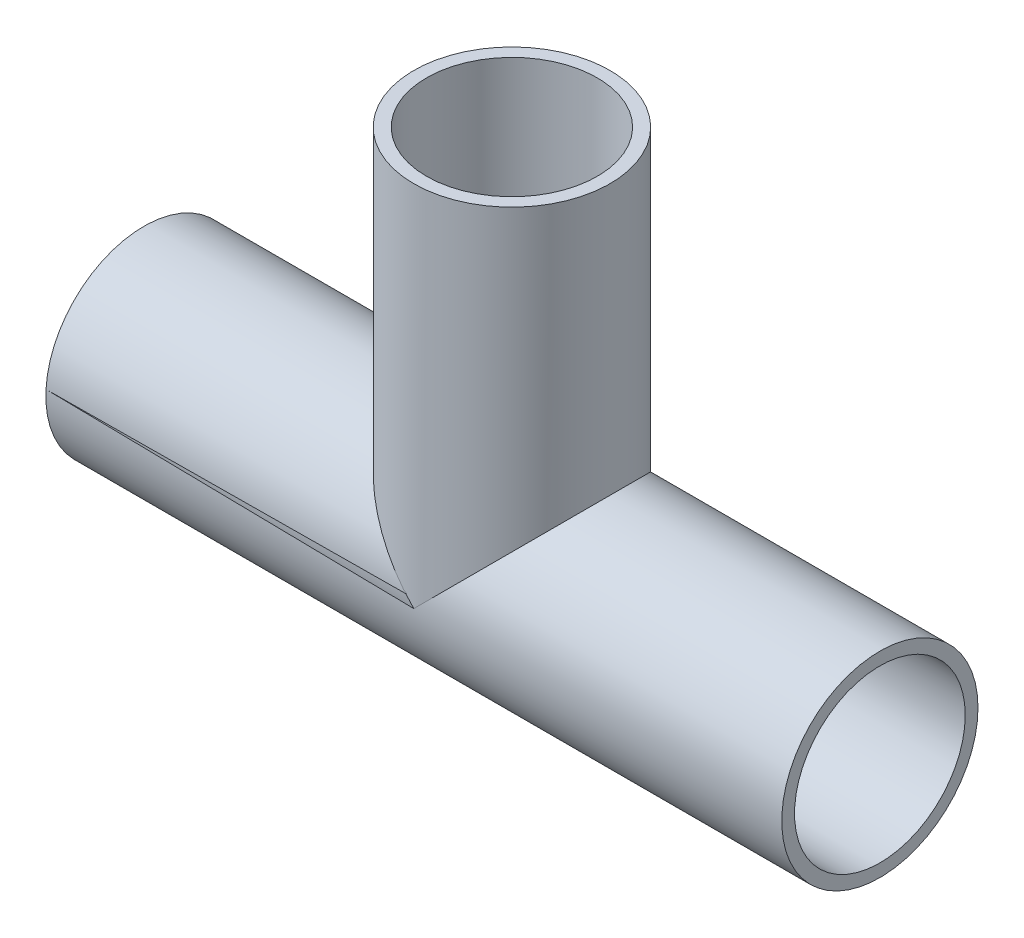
ISO-10303-21;
HEADER;
FILE_DESCRIPTION(('STEP AP214'),'2;1');
FILE_NAME('part.step','',(''),(''),'','','');
FILE_SCHEMA(('AUTOMOTIVE_DESIGN { 1 0 10303 214 1 1 1 1 }'));
ENDSEC;
DATA;
#1=APPLICATION_CONTEXT('core data for automotive mechanical design processes');
#2=APPLICATION_PROTOCOL_DEFINITION('international standard','automotive_design',2000,#1);
#3=PRODUCT_CONTEXT('',#1,'mechanical');
#4=PRODUCT('Part','Part','',(#3));
#5=PRODUCT_RELATED_PRODUCT_CATEGORY('part','',(#4));
#6=PRODUCT_DEFINITION_FORMATION('','',#4);
#7=PRODUCT_DEFINITION_CONTEXT('part definition',#1,'design');
#8=PRODUCT_DEFINITION('design','',#6,#7);
#9=PRODUCT_DEFINITION_SHAPE('','',#8);
#10=(LENGTH_UNIT() NAMED_UNIT(*) SI_UNIT(.MILLI.,.METRE.));
#11=(NAMED_UNIT(*) PLANE_ANGLE_UNIT() SI_UNIT($,.RADIAN.));
#12=(NAMED_UNIT(*) SI_UNIT($,.STERADIAN.) SOLID_ANGLE_UNIT());
#13=UNCERTAINTY_MEASURE_WITH_UNIT(LENGTH_MEASURE(1.E-05),#10,'distance_accuracy_value','');
#14=(GEOMETRIC_REPRESENTATION_CONTEXT(3) GLOBAL_UNCERTAINTY_ASSIGNED_CONTEXT((#13)) GLOBAL_UNIT_ASSIGNED_CONTEXT((#10,
#11,#12)) REPRESENTATION_CONTEXT('',''));
#15=CARTESIAN_POINT('',(0.,0.,0.));
#16=DIRECTION('',(0.,0.,1.));
#17=DIRECTION('',(1.,0.,0.));
#18=AXIS2_PLACEMENT_3D('',#15,#16,#17);
#19=CARTESIAN_POINT('',(-47.625,0.,0.));
#20=DIRECTION('',(1.,0.,0.));
#21=DIRECTION('',(0.,0.,-1.));
#22=AXIS2_PLACEMENT_3D('',#19,#20,#21);
#23=CYLINDRICAL_SURFACE('',#22,12.7);
#24=CARTESIAN_POINT('',(47.625,0.,0.));
#25=DIRECTION('',(1.,0.,0.));
#26=DIRECTION('',(0.,0.,-1.));
#27=AXIS2_PLACEMENT_3D('',#24,#25,#26);
#28=CIRCLE('',#27,12.7);
#29=CARTESIAN_POINT('',(47.625,0.,-12.7));
#30=VERTEX_POINT('',#29);
#31=EDGE_CURVE('E75',#30,#30,#28,.T.);
#32=ORIENTED_EDGE('',*,*,#31,.F.);
#33=EDGE_LOOP('',(#32));
#34=FACE_BOUND('',#33,.T.);
#35=CARTESIAN_POINT('',(-47.625,0.,0.));
#36=DIRECTION('',(1.,0.,0.));
#37=DIRECTION('',(0.,0.,-1.));
#38=AXIS2_PLACEMENT_3D('',#35,#36,#37);
#39=CIRCLE('',#38,12.7);
#40=CARTESIAN_POINT('',(-47.625,0.,-12.7));
#41=VERTEX_POINT('',#40);
#42=EDGE_CURVE('E78',#41,#41,#39,.T.);
#43=ORIENTED_EDGE('',*,*,#42,.T.);
#44=EDGE_LOOP('',(#43));
#45=FACE_BOUND('',#44,.T.);
#46=CARTESIAN_POINT('',(0.,0.,0.));
#47=DIRECTION('',(0.707106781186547,-0.707106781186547,0.));
#48=DIRECTION('',(-0.707106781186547,-0.707106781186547,0.));
#49=AXIS2_PLACEMENT_3D('',#46,#47,#48);
#50=ELLIPSE('',#49,17.9605122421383,12.7);
#51=CARTESIAN_POINT('',(0.,0.,12.7));
#52=VERTEX_POINT('',#51);
#53=CARTESIAN_POINT('',(0.,0.,-12.7));
#54=VERTEX_POINT('',#53);
#55=EDGE_CURVE('E41',#52,#54,#50,.F.);
#56=ORIENTED_EDGE('',*,*,#55,.F.);
#57=CARTESIAN_POINT('',(0.,0.,0.));
#58=DIRECTION('',(-0.707106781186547,-0.707106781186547,0.));
#59=DIRECTION('',(0.707106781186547,-0.707106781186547,0.));
#60=AXIS2_PLACEMENT_3D('',#57,#58,#59);
#61=ELLIPSE('',#60,17.9605122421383,12.7);
#62=EDGE_CURVE('E81',#54,#52,#61,.F.);
#63=ORIENTED_EDGE('',*,*,#62,.F.);
#64=EDGE_LOOP('',(#56,#63));
#65=FACE_BOUND('',#64,.T.);
#66=ADVANCED_FACE('F33',(#34,#45,#65),#23,.T.);
#67=CARTESIAN_POINT('',(-47.625,0.,0.));
#68=DIRECTION('',(1.,0.,0.));
#69=DIRECTION('',(0.,0.,-1.));
#70=AXIS2_PLACEMENT_3D('',#67,#68,#69);
#71=PLANE('',#70);
#72=CARTESIAN_POINT('',(-47.625,0.,0.));
#73=DIRECTION('',(1.,0.,0.));
#74=DIRECTION('',(0.,0.,-1.));
#75=AXIS2_PLACEMENT_3D('',#72,#73,#74);
#76=CIRCLE('',#75,11.049);
#77=CARTESIAN_POINT('',(-47.625,0.,-11.049));
#78=VERTEX_POINT('',#77);
#79=EDGE_CURVE('E66',#78,#78,#76,.F.);
#80=ORIENTED_EDGE('',*,*,#79,.F.);
#81=EDGE_LOOP('',(#80));
#82=FACE_BOUND('',#81,.T.);
#83=ORIENTED_EDGE('',*,*,#42,.F.);
#84=EDGE_LOOP('',(#83));
#85=FACE_BOUND('',#84,.T.);
#86=ADVANCED_FACE('F84',(#82,#85),#71,.F.);
#87=CARTESIAN_POINT('',(47.625,0.,0.));
#88=DIRECTION('',(1.,0.,0.));
#89=DIRECTION('',(0.,0.,-1.));
#90=AXIS2_PLACEMENT_3D('',#87,#88,#89);
#91=PLANE('',#90);
#92=CARTESIAN_POINT('',(47.625,0.,0.));
#93=DIRECTION('',(1.,0.,0.));
#94=DIRECTION('',(0.,0.,-1.));
#95=AXIS2_PLACEMENT_3D('',#92,#93,#94);
#96=CIRCLE('',#95,11.049);
#97=CARTESIAN_POINT('',(47.625,0.,-11.049));
#98=VERTEX_POINT('',#97);
#99=EDGE_CURVE('E62',#98,#98,#96,.T.);
#100=ORIENTED_EDGE('',*,*,#99,.F.);
#101=EDGE_LOOP('',(#100));
#102=FACE_BOUND('',#101,.T.);
#103=ORIENTED_EDGE('',*,*,#31,.T.);
#104=EDGE_LOOP('',(#103));
#105=FACE_BOUND('',#104,.T.);
#106=ADVANCED_FACE('F90',(#102,#105),#91,.T.);
#107=CARTESIAN_POINT('',(0.,47.625,0.));
#108=DIRECTION('',(0.,-1.,0.));
#109=DIRECTION('',(0.,0.,-1.));
#110=AXIS2_PLACEMENT_3D('',#107,#108,#109);
#111=CYLINDRICAL_SURFACE('',#110,12.7);
#112=CARTESIAN_POINT('',(0.,47.625,0.));
#113=DIRECTION('',(0.,1.,0.));
#114=DIRECTION('',(0.,0.,1.));
#115=AXIS2_PLACEMENT_3D('',#112,#113,#114);
#116=CIRCLE('',#115,12.7);
#117=CARTESIAN_POINT('',(0.,47.625,12.7));
#118=VERTEX_POINT('',#117);
#119=EDGE_CURVE('E11',#118,#118,#116,.T.);
#120=ORIENTED_EDGE('',*,*,#119,.F.);
#121=EDGE_LOOP('',(#120));
#122=FACE_BOUND('',#121,.T.);
#123=ORIENTED_EDGE('',*,*,#62,.T.);
#124=ORIENTED_EDGE('',*,*,#55,.T.);
#125=EDGE_LOOP('',(#123,#124));
#126=FACE_BOUND('',#125,.T.);
#127=ADVANCED_FACE('F35',(#122,#126),#111,.T.);
#128=CARTESIAN_POINT('',(0.,47.625,0.));
#129=DIRECTION('',(0.,1.,0.));
#130=DIRECTION('',(0.,0.,1.));
#131=AXIS2_PLACEMENT_3D('',#128,#129,#130);
#132=PLANE('',#131);
#133=CARTESIAN_POINT('',(0.,47.625,0.));
#134=DIRECTION('',(0.,1.,0.));
#135=DIRECTION('',(0.,0.,1.));
#136=AXIS2_PLACEMENT_3D('',#133,#134,#135);
#137=CIRCLE('',#136,11.049);
#138=CARTESIAN_POINT('',(0.,47.625,11.049));
#139=VERTEX_POINT('',#138);
#140=EDGE_CURVE('E69',#139,#139,#137,.T.);
#141=ORIENTED_EDGE('',*,*,#140,.F.);
#142=EDGE_LOOP('',(#141));
#143=FACE_BOUND('',#142,.T.);
#144=ORIENTED_EDGE('',*,*,#119,.T.);
#145=EDGE_LOOP('',(#144));
#146=FACE_BOUND('',#145,.T.);
#147=ADVANCED_FACE('F96',(#143,#146),#132,.T.);
#148=CARTESIAN_POINT('',(0.,0.,0.));
#149=DIRECTION('',(0.,1.,0.));
#150=DIRECTION('',(0.,0.,1.));
#151=AXIS2_PLACEMENT_3D('',#148,#149,#150);
#152=CYLINDRICAL_SURFACE('',#151,11.049);
#153=CARTESIAN_POINT('',(0.,0.,0.));
#154=DIRECTION('',(0.707106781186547,-0.707106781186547,0.));
#155=DIRECTION('',(0.707106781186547,0.707106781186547,0.));
#156=AXIS2_PLACEMENT_3D('',#153,#154,#155);
#157=ELLIPSE('',#156,15.6256456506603,11.049);
#158=CARTESIAN_POINT('',(0.,0.,11.049));
#159=VERTEX_POINT('',#158);
#160=CARTESIAN_POINT('',(0.,0.,-11.049));
#161=VERTEX_POINT('',#160);
#162=EDGE_CURVE('E58',#159,#161,#157,.F.);
#163=ORIENTED_EDGE('',*,*,#162,.F.);
#164=CARTESIAN_POINT('',(0.,0.,0.));
#165=DIRECTION('',(0.707106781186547,0.707106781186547,0.));
#166=DIRECTION('',(0.707106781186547,-0.707106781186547,0.));
#167=AXIS2_PLACEMENT_3D('',#164,#165,#166);
#168=ELLIPSE('',#167,15.6256456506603,11.049);
#169=EDGE_CURVE('E47',#161,#159,#168,.T.);
#170=ORIENTED_EDGE('',*,*,#169,.F.);
#171=EDGE_LOOP('',(#163,#170));
#172=FACE_BOUND('',#171,.T.);
#173=ORIENTED_EDGE('',*,*,#140,.T.);
#174=EDGE_LOOP('',(#173));
#175=FACE_BOUND('',#174,.T.);
#176=ADVANCED_FACE('F64',(#172,#175),#152,.F.);
#177=CARTESIAN_POINT('',(-47.626,0.,0.));
#178=DIRECTION('',(1.,0.,0.));
#179=DIRECTION('',(0.,0.,-1.));
#180=AXIS2_PLACEMENT_3D('',#177,#178,#179);
#181=CYLINDRICAL_SURFACE('',#180,11.049);
#182=ORIENTED_EDGE('',*,*,#169,.T.);
#183=ORIENTED_EDGE('',*,*,#162,.T.);
#184=EDGE_LOOP('',(#182,#183));
#185=FACE_BOUND('',#184,.T.);
#186=ORIENTED_EDGE('',*,*,#99,.T.);
#187=EDGE_LOOP('',(#186));
#188=FACE_BOUND('',#187,.T.);
#189=ORIENTED_EDGE('',*,*,#79,.T.);
#190=EDGE_LOOP('',(#189));
#191=FACE_BOUND('',#190,.T.);
#192=ADVANCED_FACE('F59',(#185,#188,#191),#181,.F.);
#193=CLOSED_SHELL('',(#66,#86,#106,#127,#147,#176,#192));
#194=MANIFOLD_SOLID_BREP('B2',#193);
#195=ADVANCED_BREP_SHAPE_REPRESENTATION('',(#18,#194),#14);
#196=SHAPE_DEFINITION_REPRESENTATION(#9,#195);
ENDSEC;
END-ISO-10303-21;
